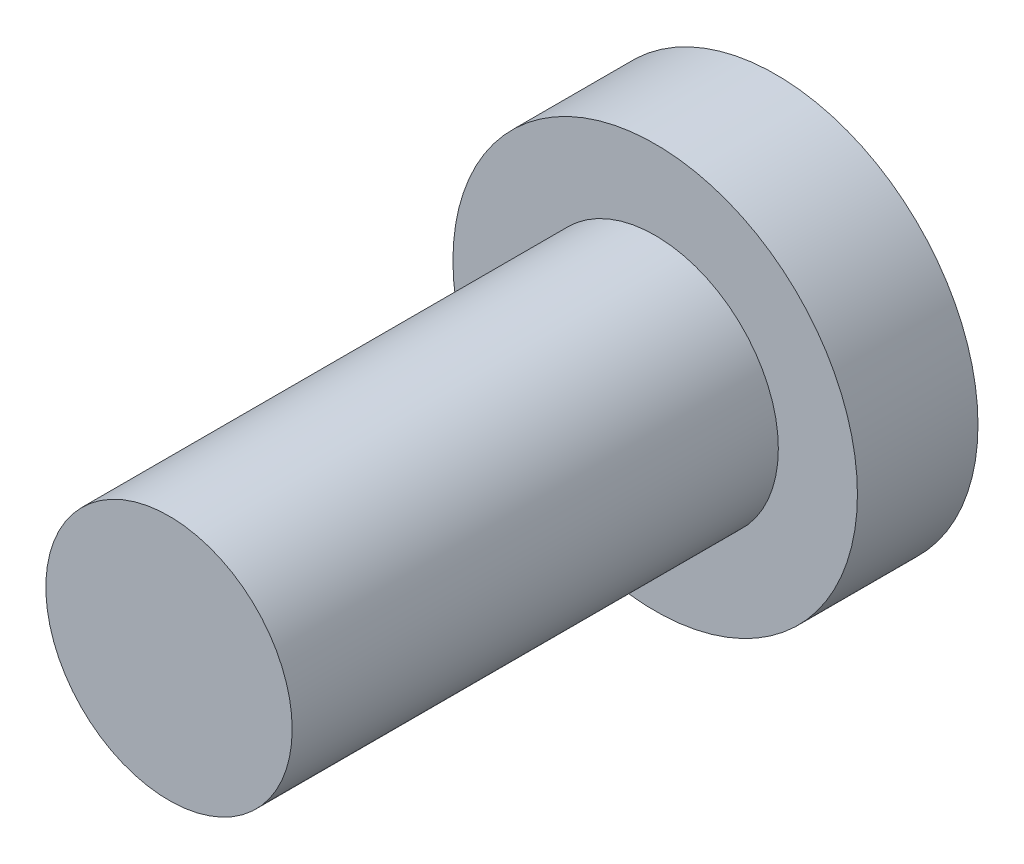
ISO-10303-21;
HEADER;
FILE_DESCRIPTION(('STEP AP214'),'2;1');
FILE_NAME('part.step','',(''),(''),'','','');
FILE_SCHEMA(('AUTOMOTIVE_DESIGN { 1 0 10303 214 1 1 1 1 }'));
ENDSEC;
DATA;
#1=APPLICATION_CONTEXT('core data for automotive mechanical design processes');
#2=APPLICATION_PROTOCOL_DEFINITION('international standard','automotive_design',2000,#1);
#3=PRODUCT_CONTEXT('',#1,'mechanical');
#4=PRODUCT('Part','Part','',(#3));
#5=PRODUCT_RELATED_PRODUCT_CATEGORY('part','',(#4));
#6=PRODUCT_DEFINITION_FORMATION('','',#4);
#7=PRODUCT_DEFINITION_CONTEXT('part definition',#1,'design');
#8=PRODUCT_DEFINITION('design','',#6,#7);
#9=PRODUCT_DEFINITION_SHAPE('','',#8);
#10=(LENGTH_UNIT() NAMED_UNIT(*) SI_UNIT(.MILLI.,.METRE.));
#11=(NAMED_UNIT(*) PLANE_ANGLE_UNIT() SI_UNIT($,.RADIAN.));
#12=(NAMED_UNIT(*) SI_UNIT($,.STERADIAN.) SOLID_ANGLE_UNIT());
#13=UNCERTAINTY_MEASURE_WITH_UNIT(LENGTH_MEASURE(1.E-05),#10,'distance_accuracy_value','');
#14=(GEOMETRIC_REPRESENTATION_CONTEXT(3) GLOBAL_UNCERTAINTY_ASSIGNED_CONTEXT((#13)) GLOBAL_UNIT_ASSIGNED_CONTEXT((#10,
#11,#12)) REPRESENTATION_CONTEXT('',''));
#15=CARTESIAN_POINT('',(0.,0.,0.));
#16=DIRECTION('',(0.,0.,1.));
#17=DIRECTION('',(1.,0.,0.));
#18=AXIS2_PLACEMENT_3D('',#15,#16,#17);
#19=CARTESIAN_POINT('',(0.,0.,9.525));
#20=DIRECTION('',(0.,0.,1.));
#21=DIRECTION('',(1.,0.,0.));
#22=AXIS2_PLACEMENT_3D('',#19,#20,#21);
#23=PLANE('',#22);
#24=CARTESIAN_POINT('',(0.,0.,9.525));
#25=DIRECTION('',(0.,0.,1.));
#26=DIRECTION('',(1.,0.,0.));
#27=AXIS2_PLACEMENT_3D('',#24,#25,#26);
#28=CIRCLE('',#27,2.413);
#29=CARTESIAN_POINT('',(2.413,0.,9.525));
#30=VERTEX_POINT('',#29);
#31=EDGE_CURVE('E11',#30,#30,#28,.T.);
#32=ORIENTED_EDGE('',*,*,#31,.T.);
#33=EDGE_LOOP('',(#32));
#34=FACE_BOUND('',#33,.T.);
#35=ADVANCED_FACE('F37',(#34),#23,.T.);
#36=CARTESIAN_POINT('',(0.,0.,9.525));
#37=DIRECTION('',(0.,0.,1.));
#38=DIRECTION('',(1.,0.,0.));
#39=AXIS2_PLACEMENT_3D('',#36,#37,#38);
#40=CYLINDRICAL_SURFACE('',#39,2.413);
#41=CARTESIAN_POINT('',(0.,0.,0.));
#42=DIRECTION('',(0.,0.,1.));
#43=DIRECTION('',(1.,0.,0.));
#44=AXIS2_PLACEMENT_3D('',#41,#42,#43);
#45=CIRCLE('',#44,2.413);
#46=CARTESIAN_POINT('',(2.413,0.,0.));
#47=VERTEX_POINT('',#46);
#48=EDGE_CURVE('E44',#47,#47,#45,.T.);
#49=ORIENTED_EDGE('',*,*,#48,.T.);
#50=EDGE_LOOP('',(#49));
#51=FACE_BOUND('',#50,.T.);
#52=ORIENTED_EDGE('',*,*,#31,.F.);
#53=EDGE_LOOP('',(#52));
#54=FACE_BOUND('',#53,.T.);
#55=ADVANCED_FACE('F151',(#51,#54),#40,.T.);
#56=CARTESIAN_POINT('',(0.,-2.413,0.));
#57=DIRECTION('',(0.,0.,1.));
#58=DIRECTION('',(1.,0.,0.));
#59=AXIS2_PLACEMENT_3D('',#56,#57,#58);
#60=PLANE('',#59);
#61=CARTESIAN_POINT('',(0.,0.,0.));
#62=DIRECTION('',(0.,0.,1.));
#63=DIRECTION('',(1.,0.,0.));
#64=AXIS2_PLACEMENT_3D('',#61,#62,#63);
#65=CIRCLE('',#64,3.9624);
#66=CARTESIAN_POINT('',(3.9624,0.,0.));
#67=VERTEX_POINT('',#66);
#68=EDGE_CURVE('E146',#67,#67,#65,.T.);
#69=ORIENTED_EDGE('',*,*,#68,.T.);
#70=EDGE_LOOP('',(#69));
#71=FACE_BOUND('',#70,.T.);
#72=ORIENTED_EDGE('',*,*,#48,.F.);
#73=EDGE_LOOP('',(#72));
#74=FACE_BOUND('',#73,.T.);
#75=ADVANCED_FACE('F154',(#71,#74),#60,.T.);
#76=CARTESIAN_POINT('',(0.,0.,9.525));
#77=DIRECTION('',(0.,0.,1.));
#78=DIRECTION('',(1.,0.,0.));
#79=AXIS2_PLACEMENT_3D('',#76,#77,#78);
#80=CYLINDRICAL_SURFACE('',#79,3.9624);
#81=CARTESIAN_POINT('',(0.,0.,-2.3622));
#82=DIRECTION('',(0.,0.,1.));
#83=DIRECTION('',(1.,0.,0.));
#84=AXIS2_PLACEMENT_3D('',#81,#82,#83);
#85=CIRCLE('',#84,3.9624);
#86=CARTESIAN_POINT('',(3.9624,0.,-2.3622));
#87=VERTEX_POINT('',#86);
#88=EDGE_CURVE('E138',#87,#87,#85,.T.);
#89=ORIENTED_EDGE('',*,*,#88,.T.);
#90=EDGE_LOOP('',(#89));
#91=FACE_BOUND('',#90,.T.);
#92=ORIENTED_EDGE('',*,*,#68,.F.);
#93=EDGE_LOOP('',(#92));
#94=FACE_BOUND('',#93,.T.);
#95=ADVANCED_FACE('F156',(#91,#94),#80,.T.);
#96=CARTESIAN_POINT('',(0.,-3.9624,-2.3622));
#97=DIRECTION('',(0.,0.,-1.));
#98=DIRECTION('',(-1.,0.,0.));
#99=AXIS2_PLACEMENT_3D('',#96,#97,#98);
#100=PLANE('',#99);
#101=DIRECTION('',(0.866025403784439,-0.5,0.));
#102=VECTOR('',#101,1.);
#103=CARTESIAN_POINT('',(0.,1.36381680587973,-2.3622));
#104=LINE('',#103,#102);
#105=CARTESIAN_POINT('',(0.,1.36381680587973,-2.3622));
#106=VERTEX_POINT('',#105);
#107=CARTESIAN_POINT('',(1.1811,0.681908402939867,-2.3622));
#108=VERTEX_POINT('',#107);
#109=EDGE_CURVE('E51',#106,#108,#104,.T.);
#110=ORIENTED_EDGE('',*,*,#109,.F.);
#111=DIRECTION('',(0.866025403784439,0.5,0.));
#112=VECTOR('',#111,1.);
#113=CARTESIAN_POINT('',(-1.1811,0.681908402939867,-2.3622));
#114=LINE('',#113,#112);
#115=CARTESIAN_POINT('',(-1.1811,0.681908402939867,-2.3622));
#116=VERTEX_POINT('',#115);
#117=EDGE_CURVE('E134',#116,#106,#114,.T.);
#118=ORIENTED_EDGE('',*,*,#117,.F.);
#119=DIRECTION('',(0.,1.,0.));
#120=VECTOR('',#119,1.);
#121=CARTESIAN_POINT('',(-1.1811,-0.681908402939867,-2.3622));
#122=LINE('',#121,#120);
#123=CARTESIAN_POINT('',(-1.1811,-0.681908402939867,-2.3622));
#124=VERTEX_POINT('',#123);
#125=EDGE_CURVE('E132',#124,#116,#122,.T.);
#126=ORIENTED_EDGE('',*,*,#125,.F.);
#127=DIRECTION('',(-0.866025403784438,0.5,0.));
#128=VECTOR('',#127,1.);
#129=CARTESIAN_POINT('',(0.,-1.36381680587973,-2.3622));
#130=LINE('',#129,#128);
#131=CARTESIAN_POINT('',(0.,-1.36381680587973,-2.3622));
#132=VERTEX_POINT('',#131);
#133=EDGE_CURVE('E99',#132,#124,#130,.T.);
#134=ORIENTED_EDGE('',*,*,#133,.F.);
#135=DIRECTION('',(-0.866025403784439,-0.5,0.));
#136=VECTOR('',#135,1.);
#137=CARTESIAN_POINT('',(1.1811,-0.681908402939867,-2.3622));
#138=LINE('',#137,#136);
#139=CARTESIAN_POINT('',(1.1811,-0.681908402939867,-2.3622));
#140=VERTEX_POINT('',#139);
#141=EDGE_CURVE('E128',#140,#132,#138,.T.);
#142=ORIENTED_EDGE('',*,*,#141,.F.);
#143=DIRECTION('',(0.,-1.,0.));
#144=VECTOR('',#143,1.);
#145=CARTESIAN_POINT('',(1.1811,0.681908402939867,-2.3622));
#146=LINE('',#145,#144);
#147=EDGE_CURVE('E125',#108,#140,#146,.T.);
#148=ORIENTED_EDGE('',*,*,#147,.F.);
#149=EDGE_LOOP('',(#110,#118,#126,#134,#142,#148));
#150=FACE_BOUND('',#149,.T.);
#151=ORIENTED_EDGE('',*,*,#88,.F.);
#152=EDGE_LOOP('',(#151));
#153=FACE_BOUND('',#152,.T.);
#154=ADVANCED_FACE('F163',(#150,#153),#100,.T.);
#155=CARTESIAN_POINT('',(0.,1.36381680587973,-0.3302));
#156=DIRECTION('',(0.5,0.866025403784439,0.));
#157=DIRECTION('',(-0.866025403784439,0.5,0.));
#158=AXIS2_PLACEMENT_3D('',#155,#156,#157);
#159=PLANE('',#158);
#160=ORIENTED_EDGE('',*,*,#109,.T.);
#161=DIRECTION('',(0.,0.,-1.));
#162=VECTOR('',#161,1.);
#163=CARTESIAN_POINT('',(1.1811,0.681908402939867,-0.3302));
#164=LINE('',#163,#162);
#165=CARTESIAN_POINT('',(1.1811,0.681908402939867,-0.3302));
#166=VERTEX_POINT('',#165);
#167=EDGE_CURVE('E81',#166,#108,#164,.T.);
#168=ORIENTED_EDGE('',*,*,#167,.F.);
#169=DIRECTION('',(0.866025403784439,-0.5,0.));
#170=VECTOR('',#169,1.);
#171=CARTESIAN_POINT('',(0.,1.36381680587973,-0.3302));
#172=LINE('',#171,#170);
#173=CARTESIAN_POINT('',(0.,1.36381680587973,-0.3302));
#174=VERTEX_POINT('',#173);
#175=EDGE_CURVE('E136',#174,#166,#172,.T.);
#176=ORIENTED_EDGE('',*,*,#175,.F.);
#177=DIRECTION('',(0.,0.,-1.));
#178=VECTOR('',#177,1.);
#179=CARTESIAN_POINT('',(0.,1.36381680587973,-0.3302));
#180=LINE('',#179,#178);
#181=EDGE_CURVE('E59',#174,#106,#180,.T.);
#182=ORIENTED_EDGE('',*,*,#181,.T.);
#183=EDGE_LOOP('',(#160,#168,#176,#182));
#184=FACE_BOUND('',#183,.T.);
#185=ADVANCED_FACE('F197',(#184),#159,.F.);
#186=CARTESIAN_POINT('',(-1.1811,0.681908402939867,-0.3302));
#187=DIRECTION('',(-0.5,0.866025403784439,0.));
#188=DIRECTION('',(-0.866025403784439,-0.5,0.));
#189=AXIS2_PLACEMENT_3D('',#186,#187,#188);
#190=PLANE('',#189);
#191=ORIENTED_EDGE('',*,*,#117,.T.);
#192=ORIENTED_EDGE('',*,*,#181,.F.);
#193=DIRECTION('',(0.866025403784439,0.5,0.));
#194=VECTOR('',#193,1.);
#195=CARTESIAN_POINT('',(-1.1811,0.681908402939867,-0.3302));
#196=LINE('',#195,#194);
#197=CARTESIAN_POINT('',(-1.1811,0.681908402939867,-0.3302));
#198=VERTEX_POINT('',#197);
#199=EDGE_CURVE('E111',#198,#174,#196,.T.);
#200=ORIENTED_EDGE('',*,*,#199,.F.);
#201=DIRECTION('',(0.,0.,-1.));
#202=VECTOR('',#201,1.);
#203=CARTESIAN_POINT('',(-1.1811,0.681908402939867,-0.3302));
#204=LINE('',#203,#202);
#205=EDGE_CURVE('E103',#198,#116,#204,.T.);
#206=ORIENTED_EDGE('',*,*,#205,.T.);
#207=EDGE_LOOP('',(#191,#192,#200,#206));
#208=FACE_BOUND('',#207,.T.);
#209=ADVANCED_FACE('F208',(#208),#190,.F.);
#210=CARTESIAN_POINT('',(-1.1811,-0.681908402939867,-0.3302));
#211=DIRECTION('',(-1.,0.,0.));
#212=DIRECTION('',(0.,-1.,0.));
#213=AXIS2_PLACEMENT_3D('',#210,#211,#212);
#214=PLANE('',#213);
#215=ORIENTED_EDGE('',*,*,#125,.T.);
#216=ORIENTED_EDGE('',*,*,#205,.F.);
#217=DIRECTION('',(0.,1.,0.));
#218=VECTOR('',#217,1.);
#219=CARTESIAN_POINT('',(-1.1811,-0.681908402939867,-0.3302));
#220=LINE('',#219,#218);
#221=CARTESIAN_POINT('',(-1.1811,-0.681908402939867,-0.3302));
#222=VERTEX_POINT('',#221);
#223=EDGE_CURVE('E107',#222,#198,#220,.T.);
#224=ORIENTED_EDGE('',*,*,#223,.F.);
#225=DIRECTION('',(0.,0.,-1.));
#226=VECTOR('',#225,1.);
#227=CARTESIAN_POINT('',(-1.1811,-0.681908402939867,-0.3302));
#228=LINE('',#227,#226);
#229=EDGE_CURVE('E92',#222,#124,#228,.T.);
#230=ORIENTED_EDGE('',*,*,#229,.T.);
#231=EDGE_LOOP('',(#215,#216,#224,#230));
#232=FACE_BOUND('',#231,.T.);
#233=ADVANCED_FACE('F108',(#232),#214,.F.);
#234=CARTESIAN_POINT('',(0.,-1.36381680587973,-0.3302));
#235=DIRECTION('',(-0.5,-0.866025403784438,0.));
#236=DIRECTION('',(0.866025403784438,-0.5,0.));
#237=AXIS2_PLACEMENT_3D('',#234,#235,#236);
#238=PLANE('',#237);
#239=ORIENTED_EDGE('',*,*,#133,.T.);
#240=ORIENTED_EDGE('',*,*,#229,.F.);
#241=DIRECTION('',(-0.866025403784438,0.5,0.));
#242=VECTOR('',#241,1.);
#243=CARTESIAN_POINT('',(0.,-1.36381680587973,-0.3302));
#244=LINE('',#243,#242);
#245=CARTESIAN_POINT('',(0.,-1.36381680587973,-0.3302));
#246=VERTEX_POINT('',#245);
#247=EDGE_CURVE('E96',#246,#222,#244,.T.);
#248=ORIENTED_EDGE('',*,*,#247,.F.);
#249=DIRECTION('',(0.,0.,-1.));
#250=VECTOR('',#249,1.);
#251=CARTESIAN_POINT('',(0.,-1.36381680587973,-0.3302));
#252=LINE('',#251,#250);
#253=EDGE_CURVE('E104',#246,#132,#252,.T.);
#254=ORIENTED_EDGE('',*,*,#253,.T.);
#255=EDGE_LOOP('',(#239,#240,#248,#254));
#256=FACE_BOUND('',#255,.T.);
#257=ADVANCED_FACE('F94',(#256),#238,.F.);
#258=CARTESIAN_POINT('',(1.1811,-0.681908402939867,-0.3302));
#259=DIRECTION('',(0.5,-0.866025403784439,0.));
#260=DIRECTION('',(0.866025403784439,0.5,0.));
#261=AXIS2_PLACEMENT_3D('',#258,#259,#260);
#262=PLANE('',#261);
#263=ORIENTED_EDGE('',*,*,#141,.T.);
#264=ORIENTED_EDGE('',*,*,#253,.F.);
#265=DIRECTION('',(-0.866025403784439,-0.5,0.));
#266=VECTOR('',#265,1.);
#267=CARTESIAN_POINT('',(1.1811,-0.681908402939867,-0.3302));
#268=LINE('',#267,#266);
#269=CARTESIAN_POINT('',(1.1811,-0.681908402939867,-0.3302));
#270=VERTEX_POINT('',#269);
#271=EDGE_CURVE('E117',#270,#246,#268,.T.);
#272=ORIENTED_EDGE('',*,*,#271,.F.);
#273=DIRECTION('',(0.,0.,-1.));
#274=VECTOR('',#273,1.);
#275=CARTESIAN_POINT('',(1.1811,-0.681908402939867,-0.3302));
#276=LINE('',#275,#274);
#277=EDGE_CURVE('E141',#270,#140,#276,.T.);
#278=ORIENTED_EDGE('',*,*,#277,.T.);
#279=EDGE_LOOP('',(#263,#264,#272,#278));
#280=FACE_BOUND('',#279,.T.);
#281=ADVANCED_FACE('F236',(#280),#262,.F.);
#282=CARTESIAN_POINT('',(1.1811,0.681908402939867,-0.3302));
#283=DIRECTION('',(1.,0.,0.));
#284=DIRECTION('',(0.,0.,-1.));
#285=AXIS2_PLACEMENT_3D('',#282,#283,#284);
#286=PLANE('',#285);
#287=ORIENTED_EDGE('',*,*,#147,.T.);
#288=ORIENTED_EDGE('',*,*,#277,.F.);
#289=DIRECTION('',(0.,-1.,0.));
#290=VECTOR('',#289,1.);
#291=CARTESIAN_POINT('',(1.1811,0.681908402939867,-0.3302));
#292=LINE('',#291,#290);
#293=EDGE_CURVE('E119',#166,#270,#292,.T.);
#294=ORIENTED_EDGE('',*,*,#293,.F.);
#295=ORIENTED_EDGE('',*,*,#167,.T.);
#296=EDGE_LOOP('',(#287,#288,#294,#295));
#297=FACE_BOUND('',#296,.T.);
#298=ADVANCED_FACE('F246',(#297),#286,.F.);
#299=CARTESIAN_POINT('',(2.3622,0.,-0.3302));
#300=DIRECTION('',(0.,0.,-1.));
#301=DIRECTION('',(-1.,0.,0.));
#302=AXIS2_PLACEMENT_3D('',#299,#300,#301);
#303=PLANE('',#302);
#304=ORIENTED_EDGE('',*,*,#175,.T.);
#305=ORIENTED_EDGE('',*,*,#293,.T.);
#306=ORIENTED_EDGE('',*,*,#271,.T.);
#307=ORIENTED_EDGE('',*,*,#247,.T.);
#308=ORIENTED_EDGE('',*,*,#223,.T.);
#309=ORIENTED_EDGE('',*,*,#199,.T.);
#310=EDGE_LOOP('',(#304,#305,#306,#307,#308,#309));
#311=FACE_BOUND('',#310,.T.);
#312=ADVANCED_FACE('F114',(#311),#303,.T.);
#313=CLOSED_SHELL('',(#35,#55,#75,#95,#154,#185,#209,#233,#257,#281,#298,#312));
#314=MANIFOLD_SOLID_BREP('B2',#313);
#315=ADVANCED_BREP_SHAPE_REPRESENTATION('',(#18,#314),#14);
#316=SHAPE_DEFINITION_REPRESENTATION(#9,#315);
ENDSEC;
END-ISO-10303-21;
